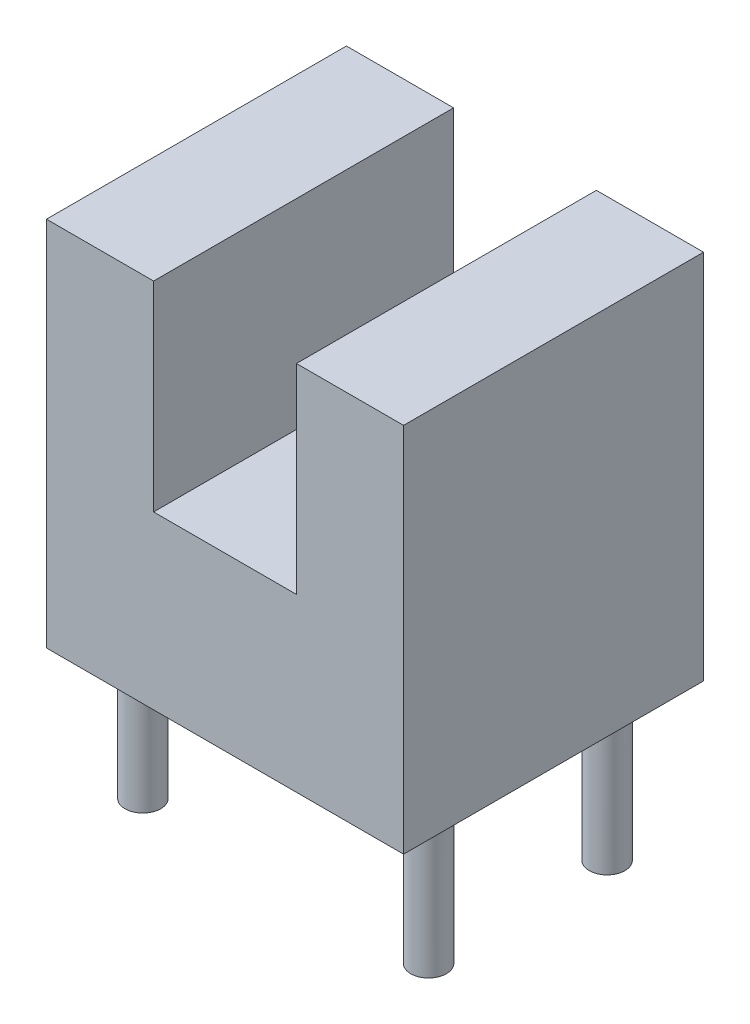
from build123d import *

# Parameters (mm, degrees)
BOSS_EXTRUDE1_DEPTH = 4.2
SKETCH2_R           = 0.25
BOSS_EXTRUDE2_DEPTH = 2


with BuildPart() as part:
    # Sketch1 → Boss-Extrude1 (new body)
    with BuildSketch(Plane.XY):
        Polygon((1, 5.2), (2.5, 5.2), (2.5, 0), (-2.5, 0), (-2.5, 5.2), (-1, 5.2), (-1, 2.4), (1, 2.4), align=None)
    extrude(amount=BOSS_EXTRUDE1_DEPTH)

    # Sketch2 → Boss-Extrude2 (add)
    with BuildSketch(Plane.XZ):
        with Locations(Location((-2, 3.35, 0), (0, 0, 180))):
            Circle(SKETCH2_R)
        with Locations(Location((2, 3.35, 0), (0, 0, 180))):
            Circle(SKETCH2_R)
        with Locations(Location((2, 0.85, 0), (0, 0, 180))):
            Circle(SKETCH2_R)
        with Locations(Location((-2, 0.85, 0), (0, 0, 180))):
            Circle(SKETCH2_R)
    extrude(amount=BOSS_EXTRUDE2_DEPTH)


solid = part.part
